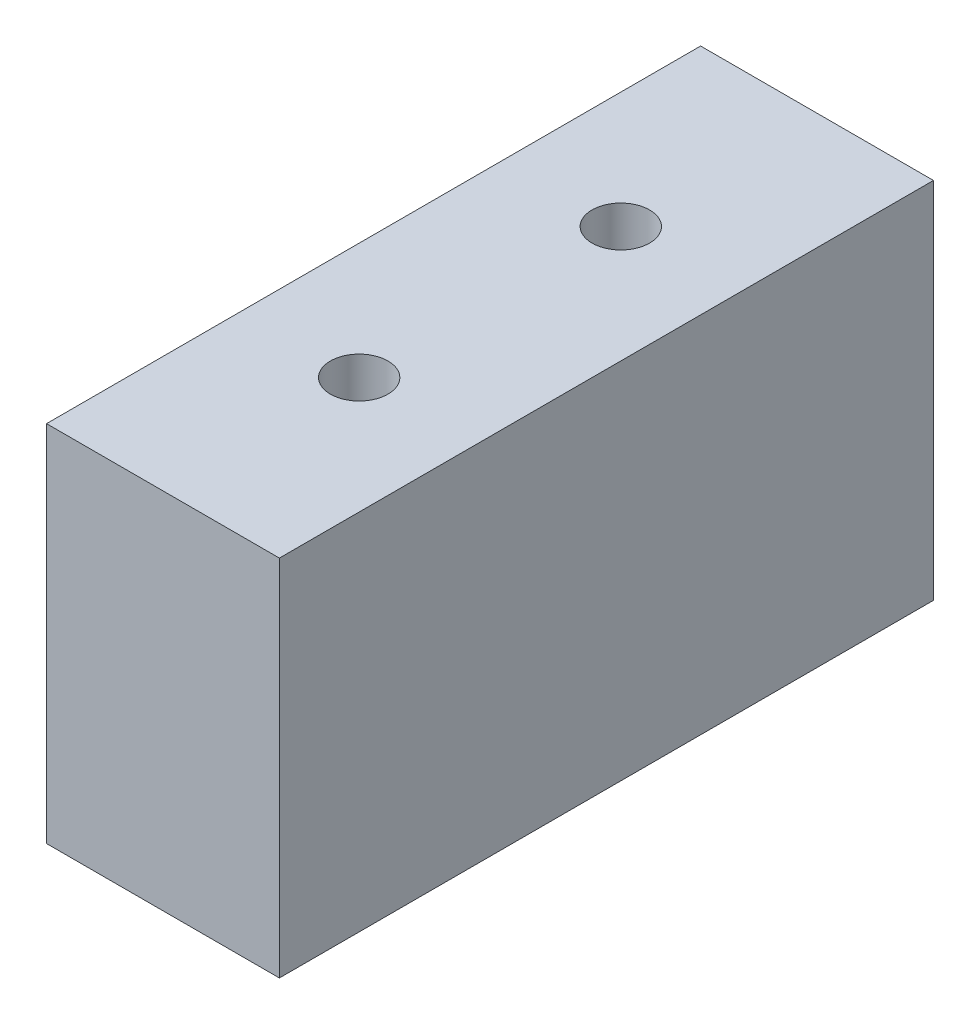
ISO-10303-21;
HEADER;
FILE_DESCRIPTION(('STEP AP214'),'2;1');
FILE_NAME('part.step','',(''),(''),'','','');
FILE_SCHEMA(('AUTOMOTIVE_DESIGN { 1 0 10303 214 1 1 1 1 }'));
ENDSEC;
DATA;
#1=APPLICATION_CONTEXT('core data for automotive mechanical design processes');
#2=APPLICATION_PROTOCOL_DEFINITION('international standard','automotive_design',2000,#1);
#3=PRODUCT_CONTEXT('',#1,'mechanical');
#4=PRODUCT('Part','Part','',(#3));
#5=PRODUCT_RELATED_PRODUCT_CATEGORY('part','',(#4));
#6=PRODUCT_DEFINITION_FORMATION('','',#4);
#7=PRODUCT_DEFINITION_CONTEXT('part definition',#1,'design');
#8=PRODUCT_DEFINITION('design','',#6,#7);
#9=PRODUCT_DEFINITION_SHAPE('','',#8);
#10=(LENGTH_UNIT() NAMED_UNIT(*) SI_UNIT(.MILLI.,.METRE.));
#11=(NAMED_UNIT(*) PLANE_ANGLE_UNIT() SI_UNIT($,.RADIAN.));
#12=(NAMED_UNIT(*) SI_UNIT($,.STERADIAN.) SOLID_ANGLE_UNIT());
#13=UNCERTAINTY_MEASURE_WITH_UNIT(LENGTH_MEASURE(1.E-05),#10,'distance_accuracy_value','');
#14=(GEOMETRIC_REPRESENTATION_CONTEXT(3) GLOBAL_UNCERTAINTY_ASSIGNED_CONTEXT((#13)) GLOBAL_UNIT_ASSIGNED_CONTEXT((#10,
#11,#12)) REPRESENTATION_CONTEXT('',''));
#15=CARTESIAN_POINT('',(0.,0.,0.));
#16=DIRECTION('',(0.,0.,1.));
#17=DIRECTION('',(1.,0.,0.));
#18=AXIS2_PLACEMENT_3D('',#15,#16,#17);
#19=CARTESIAN_POINT('',(0.,0.,0.));
#20=DIRECTION('',(0.,0.,-1.));
#21=DIRECTION('',(0.,-1.,0.));
#22=AXIS2_PLACEMENT_3D('',#19,#20,#21);
#23=PLANE('',#22);
#24=DIRECTION('',(0.,1.,0.));
#25=VECTOR('',#24,1.);
#26=CARTESIAN_POINT('',(8.9,-13.9,0.));
#27=LINE('',#26,#25);
#28=CARTESIAN_POINT('',(8.9,-13.9,0.));
#29=VERTEX_POINT('',#28);
#30=CARTESIAN_POINT('',(8.9,13.9,0.));
#31=VERTEX_POINT('',#30);
#32=EDGE_CURVE('E107',#29,#31,#27,.T.);
#33=ORIENTED_EDGE('',*,*,#32,.F.);
#34=DIRECTION('',(1.,0.,0.));
#35=VECTOR('',#34,1.);
#36=CARTESIAN_POINT('',(-8.9,-13.9,0.));
#37=LINE('',#36,#35);
#38=CARTESIAN_POINT('',(-8.9,-13.9,0.));
#39=VERTEX_POINT('',#38);
#40=EDGE_CURVE('E26',#39,#29,#37,.T.);
#41=ORIENTED_EDGE('',*,*,#40,.F.);
#42=DIRECTION('',(0.,-1.,0.));
#43=VECTOR('',#42,1.);
#44=CARTESIAN_POINT('',(-8.9,-13.9,0.));
#45=LINE('',#44,#43);
#46=CARTESIAN_POINT('',(-8.9,13.9,0.));
#47=VERTEX_POINT('',#46);
#48=EDGE_CURVE('E68',#47,#39,#45,.T.);
#49=ORIENTED_EDGE('',*,*,#48,.F.);
#50=DIRECTION('',(-1.,0.,0.));
#51=VECTOR('',#50,1.);
#52=CARTESIAN_POINT('',(-8.9,13.9,0.));
#53=LINE('',#52,#51);
#54=EDGE_CURVE('E96',#31,#47,#53,.T.);
#55=ORIENTED_EDGE('',*,*,#54,.F.);
#56=EDGE_LOOP('',(#33,#41,#49,#55));
#57=FACE_BOUND('',#56,.T.);
#58=ADVANCED_FACE('F17',(#57),#23,.T.);
#59=CARTESIAN_POINT('',(0.,0.,50.));
#60=DIRECTION('',(0.,0.,-1.));
#61=DIRECTION('',(0.,-1.,0.));
#62=AXIS2_PLACEMENT_3D('',#59,#60,#61);
#63=PLANE('',#62);
#64=DIRECTION('',(0.,1.,0.));
#65=VECTOR('',#64,1.);
#66=CARTESIAN_POINT('',(8.9,-13.9,50.));
#67=LINE('',#66,#65);
#68=CARTESIAN_POINT('',(8.9,-13.9,50.));
#69=VERTEX_POINT('',#68);
#70=CARTESIAN_POINT('',(8.9,13.9,50.));
#71=VERTEX_POINT('',#70);
#72=EDGE_CURVE('E89',#69,#71,#67,.T.);
#73=ORIENTED_EDGE('',*,*,#72,.T.);
#74=DIRECTION('',(-1.,0.,0.));
#75=VECTOR('',#74,1.);
#76=CARTESIAN_POINT('',(-8.9,13.9,50.));
#77=LINE('',#76,#75);
#78=CARTESIAN_POINT('',(-8.9,13.9,50.));
#79=VERTEX_POINT('',#78);
#80=EDGE_CURVE('E86',#71,#79,#77,.T.);
#81=ORIENTED_EDGE('',*,*,#80,.T.);
#82=DIRECTION('',(0.,-1.,0.));
#83=VECTOR('',#82,1.);
#84=CARTESIAN_POINT('',(-8.9,-13.9,50.));
#85=LINE('',#84,#83);
#86=CARTESIAN_POINT('',(-8.9,-13.9,50.));
#87=VERTEX_POINT('',#86);
#88=EDGE_CURVE('E77',#79,#87,#85,.T.);
#89=ORIENTED_EDGE('',*,*,#88,.T.);
#90=DIRECTION('',(1.,0.,0.));
#91=VECTOR('',#90,1.);
#92=CARTESIAN_POINT('',(-8.9,-13.9,50.));
#93=LINE('',#92,#91);
#94=EDGE_CURVE('E11',#87,#69,#93,.T.);
#95=ORIENTED_EDGE('',*,*,#94,.T.);
#96=EDGE_LOOP('',(#73,#81,#89,#95));
#97=FACE_BOUND('',#96,.T.);
#98=ADVANCED_FACE('F87',(#97),#63,.F.);
#99=CARTESIAN_POINT('',(-8.9,-13.9,50.));
#100=DIRECTION('',(0.,1.,0.));
#101=DIRECTION('',(1.,0.,0.));
#102=AXIS2_PLACEMENT_3D('',#99,#100,#101);
#103=PLANE('',#102);
#104=CARTESIAN_POINT('',(0.,-13.9,35.));
#105=DIRECTION('',(0.,1.,0.));
#106=DIRECTION('',(0.,0.,1.));
#107=AXIS2_PLACEMENT_3D('',#104,#105,#106);
#108=CIRCLE('',#107,2.2);
#109=CARTESIAN_POINT('',(0.,-13.9,37.2));
#110=VERTEX_POINT('',#109);
#111=EDGE_CURVE('E109',#110,#110,#108,.T.);
#112=ORIENTED_EDGE('',*,*,#111,.T.);
#113=EDGE_LOOP('',(#112));
#114=FACE_BOUND('',#113,.T.);
#115=CARTESIAN_POINT('',(0.,-13.9,15.));
#116=DIRECTION('',(0.,1.,0.));
#117=DIRECTION('',(0.,0.,1.));
#118=AXIS2_PLACEMENT_3D('',#115,#116,#117);
#119=CIRCLE('',#118,2.2);
#120=CARTESIAN_POINT('',(0.,-13.9,17.2));
#121=VERTEX_POINT('',#120);
#122=EDGE_CURVE('E163',#121,#121,#119,.T.);
#123=ORIENTED_EDGE('',*,*,#122,.T.);
#124=EDGE_LOOP('',(#123));
#125=FACE_BOUND('',#124,.T.);
#126=ORIENTED_EDGE('',*,*,#40,.T.);
#127=DIRECTION('',(0.,0.,-1.));
#128=VECTOR('',#127,1.);
#129=CARTESIAN_POINT('',(8.9,-13.9,50.));
#130=LINE('',#129,#128);
#131=EDGE_CURVE('E103',#69,#29,#130,.T.);
#132=ORIENTED_EDGE('',*,*,#131,.F.);
#133=ORIENTED_EDGE('',*,*,#94,.F.);
#134=DIRECTION('',(0.,0.,-1.));
#135=VECTOR('',#134,1.);
#136=CARTESIAN_POINT('',(-8.9,-13.9,50.));
#137=LINE('',#136,#135);
#138=EDGE_CURVE('E83',#87,#39,#137,.T.);
#139=ORIENTED_EDGE('',*,*,#138,.T.);
#140=EDGE_LOOP('',(#126,#132,#133,#139));
#141=FACE_BOUND('',#140,.T.);
#142=ADVANCED_FACE('F130',(#114,#125,#141),#103,.F.);
#143=CARTESIAN_POINT('',(-8.9,-13.9,50.));
#144=DIRECTION('',(1.,0.,0.));
#145=DIRECTION('',(0.,1.,0.));
#146=AXIS2_PLACEMENT_3D('',#143,#144,#145);
#147=PLANE('',#146);
#148=ORIENTED_EDGE('',*,*,#48,.T.);
#149=ORIENTED_EDGE('',*,*,#138,.F.);
#150=ORIENTED_EDGE('',*,*,#88,.F.);
#151=DIRECTION('',(0.,0.,-1.));
#152=VECTOR('',#151,1.);
#153=CARTESIAN_POINT('',(-8.9,13.9,50.));
#154=LINE('',#153,#152);
#155=EDGE_CURVE('E81',#79,#47,#154,.T.);
#156=ORIENTED_EDGE('',*,*,#155,.T.);
#157=EDGE_LOOP('',(#148,#149,#150,#156));
#158=FACE_BOUND('',#157,.T.);
#159=ADVANCED_FACE('F79',(#158),#147,.F.);
#160=CARTESIAN_POINT('',(-8.9,13.9,50.));
#161=DIRECTION('',(0.,-1.,0.));
#162=DIRECTION('',(0.,0.,-1.));
#163=AXIS2_PLACEMENT_3D('',#160,#161,#162);
#164=PLANE('',#163);
#165=CARTESIAN_POINT('',(0.,13.9,35.));
#166=DIRECTION('',(0.,1.,0.));
#167=DIRECTION('',(0.,0.,1.));
#168=AXIS2_PLACEMENT_3D('',#165,#166,#167);
#169=CIRCLE('',#168,2.2);
#170=CARTESIAN_POINT('',(0.,13.9,37.2));
#171=VERTEX_POINT('',#170);
#172=EDGE_CURVE('E113',#171,#171,#169,.T.);
#173=ORIENTED_EDGE('',*,*,#172,.F.);
#174=EDGE_LOOP('',(#173));
#175=FACE_BOUND('',#174,.T.);
#176=CARTESIAN_POINT('',(0.,13.9,15.));
#177=DIRECTION('',(0.,1.,0.));
#178=DIRECTION('',(0.,0.,1.));
#179=AXIS2_PLACEMENT_3D('',#176,#177,#178);
#180=CIRCLE('',#179,2.2);
#181=CARTESIAN_POINT('',(0.,13.9,17.2));
#182=VERTEX_POINT('',#181);
#183=EDGE_CURVE('E114',#182,#182,#180,.T.);
#184=ORIENTED_EDGE('',*,*,#183,.F.);
#185=EDGE_LOOP('',(#184));
#186=FACE_BOUND('',#185,.T.);
#187=ORIENTED_EDGE('',*,*,#54,.T.);
#188=ORIENTED_EDGE('',*,*,#155,.F.);
#189=ORIENTED_EDGE('',*,*,#80,.F.);
#190=DIRECTION('',(0.,0.,-1.));
#191=VECTOR('',#190,1.);
#192=CARTESIAN_POINT('',(8.9,13.9,50.));
#193=LINE('',#192,#191);
#194=EDGE_CURVE('E118',#71,#31,#193,.T.);
#195=ORIENTED_EDGE('',*,*,#194,.T.);
#196=EDGE_LOOP('',(#187,#188,#189,#195));
#197=FACE_BOUND('',#196,.T.);
#198=ADVANCED_FACE('F95',(#175,#186,#197),#164,.F.);
#199=CARTESIAN_POINT('',(8.9,-13.9,50.));
#200=DIRECTION('',(-1.,0.,0.));
#201=DIRECTION('',(0.,0.,1.));
#202=AXIS2_PLACEMENT_3D('',#199,#200,#201);
#203=PLANE('',#202);
#204=ORIENTED_EDGE('',*,*,#32,.T.);
#205=ORIENTED_EDGE('',*,*,#194,.F.);
#206=ORIENTED_EDGE('',*,*,#72,.F.);
#207=ORIENTED_EDGE('',*,*,#131,.T.);
#208=EDGE_LOOP('',(#204,#205,#206,#207));
#209=FACE_BOUND('',#208,.T.);
#210=ADVANCED_FACE('F134',(#209),#203,.F.);
#211=CARTESIAN_POINT('',(0.,-13.9,35.));
#212=DIRECTION('',(0.,1.,0.));
#213=DIRECTION('',(0.,0.,1.));
#214=AXIS2_PLACEMENT_3D('',#211,#212,#213);
#215=CYLINDRICAL_SURFACE('',#214,2.2);
#216=ORIENTED_EDGE('',*,*,#172,.T.);
#217=EDGE_LOOP('',(#216));
#218=FACE_BOUND('',#217,.T.);
#219=ORIENTED_EDGE('',*,*,#111,.F.);
#220=EDGE_LOOP('',(#219));
#221=FACE_BOUND('',#220,.T.);
#222=ADVANCED_FACE('F232',(#218,#221),#215,.F.);
#223=CARTESIAN_POINT('',(0.,-13.9,15.));
#224=DIRECTION('',(0.,1.,0.));
#225=DIRECTION('',(0.,0.,1.));
#226=AXIS2_PLACEMENT_3D('',#223,#224,#225);
#227=CYLINDRICAL_SURFACE('',#226,2.2);
#228=ORIENTED_EDGE('',*,*,#183,.T.);
#229=EDGE_LOOP('',(#228));
#230=FACE_BOUND('',#229,.T.);
#231=ORIENTED_EDGE('',*,*,#122,.F.);
#232=EDGE_LOOP('',(#231));
#233=FACE_BOUND('',#232,.T.);
#234=ADVANCED_FACE('F228',(#230,#233),#227,.F.);
#235=CLOSED_SHELL('',(#58,#98,#142,#159,#198,#210,#222,#234));
#236=MANIFOLD_SOLID_BREP('B1',#235);
#237=ADVANCED_BREP_SHAPE_REPRESENTATION('',(#18,#236),#14);
#238=SHAPE_DEFINITION_REPRESENTATION(#9,#237);
ENDSEC;
END-ISO-10303-21;
